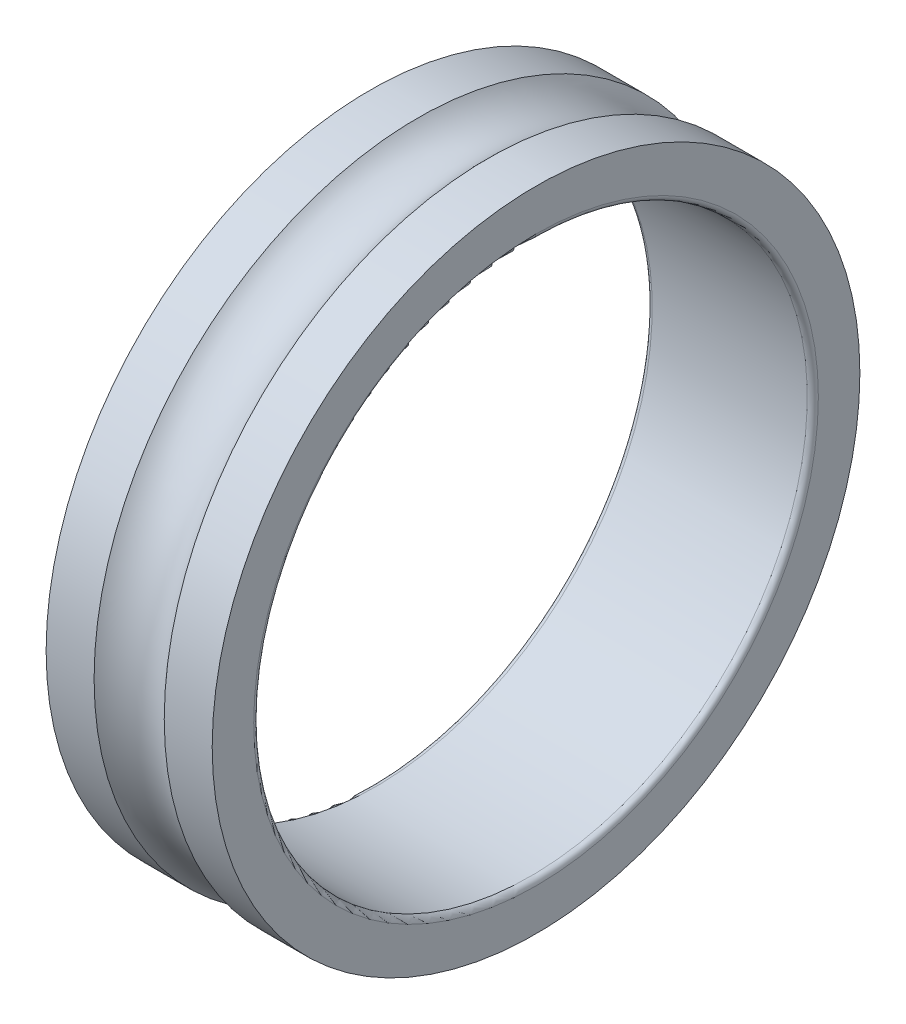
from build123d import *


with BuildPart() as part:
    # Esquisse1 → Base-R_volution (revolve)
    with BuildSketch(Plane(origin=(0, 0, 0), x_dir=(1, 0, 0), z_dir=(0, 1, 0)), mode=Mode.PRIVATE) as base_r_volution_sk:
        with BuildLine():
            Line((0, 17.55), (0, 15.3))
            ThreePointArc((0, 15.3), (0.087867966, 15.087867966), (0.3, 15))
            Line((0.3, 15), (8.7, 15))
            ThreePointArc((8.7, 15), (8.912132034, 15.087867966), (9, 15.3))
            Line((9, 15.3), (9, 17.55))
            Line((9, 17.55), (6.400657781, 17.55))
            ThreePointArc((6.400657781, 17.55), (4.5, 16.7), (2.599342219, 17.55))
            Line((2.599342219, 17.55), (0, 17.55))
        make_face()
    revolve(base_r_volution_sk.sketch.rotate(Axis((0, 0, 0), (1, 0, 0)), 180), axis=Axis((0, 0, 0), (1, 0, 0)))


solid = part.part
